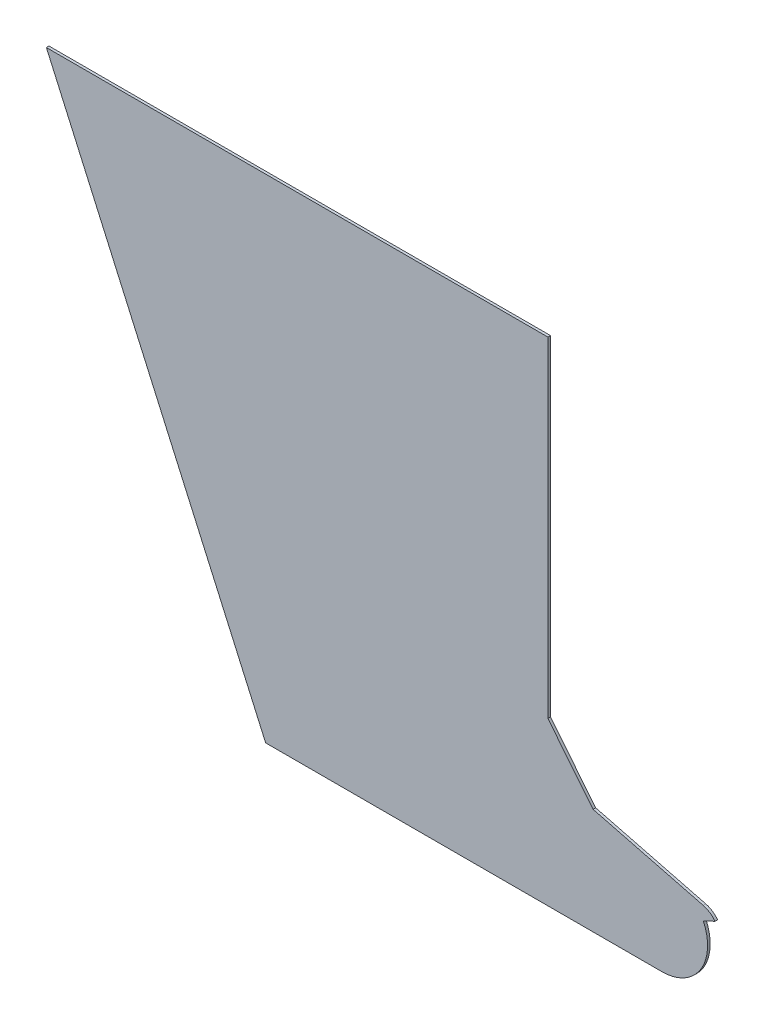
ISO-10303-21;
HEADER;
FILE_DESCRIPTION(('STEP AP214'),'2;1');
FILE_NAME('part.step','',(''),(''),'','','');
FILE_SCHEMA(('AUTOMOTIVE_DESIGN { 1 0 10303 214 1 1 1 1 }'));
ENDSEC;
DATA;
#1=APPLICATION_CONTEXT('core data for automotive mechanical design processes');
#2=APPLICATION_PROTOCOL_DEFINITION('international standard','automotive_design',2000,#1);
#3=PRODUCT_CONTEXT('',#1,'mechanical');
#4=PRODUCT('Part','Part','',(#3));
#5=PRODUCT_RELATED_PRODUCT_CATEGORY('part','',(#4));
#6=PRODUCT_DEFINITION_FORMATION('','',#4);
#7=PRODUCT_DEFINITION_CONTEXT('part definition',#1,'design');
#8=PRODUCT_DEFINITION('design','',#6,#7);
#9=PRODUCT_DEFINITION_SHAPE('','',#8);
#10=(LENGTH_UNIT() NAMED_UNIT(*) SI_UNIT(.MILLI.,.METRE.));
#11=(NAMED_UNIT(*) PLANE_ANGLE_UNIT() SI_UNIT($,.RADIAN.));
#12=(NAMED_UNIT(*) SI_UNIT($,.STERADIAN.) SOLID_ANGLE_UNIT());
#13=UNCERTAINTY_MEASURE_WITH_UNIT(LENGTH_MEASURE(1.E-05),#10,'distance_accuracy_value','');
#14=(GEOMETRIC_REPRESENTATION_CONTEXT(3) GLOBAL_UNCERTAINTY_ASSIGNED_CONTEXT((#13)) GLOBAL_UNIT_ASSIGNED_CONTEXT((#10,
#11,#12)) REPRESENTATION_CONTEXT('',''));
#15=CARTESIAN_POINT('',(0.,0.,0.));
#16=DIRECTION('',(0.,0.,1.));
#17=DIRECTION('',(1.,0.,0.));
#18=AXIS2_PLACEMENT_3D('',#15,#16,#17);
#19=CARTESIAN_POINT('',(-70.7730341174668,-885.405968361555,6.35));
#20=DIRECTION('',(0.,-1.,0.));
#21=DIRECTION('',(0.,0.,-1.));
#22=AXIS2_PLACEMENT_3D('',#19,#20,#21);
#23=PLANE('',#22);
#24=DIRECTION('',(-1.,0.,0.));
#25=VECTOR('',#24,1.);
#26=CARTESIAN_POINT('',(-70.7730341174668,-885.405968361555,0.));
#27=LINE('',#26,#25);
#28=CARTESIAN_POINT('',(1162.91174535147,-885.405968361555,0.));
#29=VERTEX_POINT('',#28);
#30=CARTESIAN_POINT('',(-70.7730341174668,-885.405968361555,0.));
#31=VERTEX_POINT('',#30);
#32=EDGE_CURVE('E134',#29,#31,#27,.T.);
#33=ORIENTED_EDGE('',*,*,#32,.T.);
#34=DIRECTION('',(0.,0.,-1.));
#35=VECTOR('',#34,1.);
#36=CARTESIAN_POINT('',(-70.7730341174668,-885.405968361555,6.35));
#37=LINE('',#36,#35);
#38=CARTESIAN_POINT('',(-70.7730341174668,-885.405968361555,6.35));
#39=VERTEX_POINT('',#38);
#40=EDGE_CURVE('E11',#39,#31,#37,.T.);
#41=ORIENTED_EDGE('',*,*,#40,.F.);
#42=DIRECTION('',(-1.,0.,0.));
#43=VECTOR('',#42,1.);
#44=CARTESIAN_POINT('',(-70.7730341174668,-885.405968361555,6.35));
#45=LINE('',#44,#43);
#46=CARTESIAN_POINT('',(1162.91174535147,-885.405968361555,6.35));
#47=VERTEX_POINT('',#46);
#48=EDGE_CURVE('E150',#47,#39,#45,.T.);
#49=ORIENTED_EDGE('',*,*,#48,.F.);
#50=DIRECTION('',(0.,0.,-1.));
#51=VECTOR('',#50,1.);
#52=CARTESIAN_POINT('',(1162.91174535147,-885.405968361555,6.35));
#53=LINE('',#52,#51);
#54=EDGE_CURVE('E130',#47,#29,#53,.T.);
#55=ORIENTED_EDGE('',*,*,#54,.T.);
#56=EDGE_LOOP('',(#33,#41,#49,#55));
#57=FACE_BOUND('',#56,.T.);
#58=ADVANCED_FACE('F32',(#57),#23,.F.);
#59=CARTESIAN_POINT('',(468.61535827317,-2097.12163758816,6.35));
#60=DIRECTION('',(0.913574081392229,0.406672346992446,0.));
#61=DIRECTION('',(-0.406672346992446,0.913574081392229,0.));
#62=AXIS2_PLACEMENT_3D('',#59,#60,#61);
#63=PLANE('',#62);
#64=DIRECTION('',(0.406672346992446,-0.913574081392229,0.));
#65=VECTOR('',#64,1.);
#66=CARTESIAN_POINT('',(468.61535827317,-2097.12163758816,0.));
#67=LINE('',#66,#65);
#68=CARTESIAN_POINT('',(468.61535827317,-2097.12163758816,0.));
#69=VERTEX_POINT('',#68);
#70=EDGE_CURVE('E137',#31,#69,#67,.T.);
#71=ORIENTED_EDGE('',*,*,#70,.T.);
#72=DIRECTION('',(0.,0.,-1.));
#73=VECTOR('',#72,1.);
#74=CARTESIAN_POINT('',(468.61535827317,-2097.12163758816,6.35));
#75=LINE('',#74,#73);
#76=CARTESIAN_POINT('',(468.61535827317,-2097.12163758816,6.35));
#77=VERTEX_POINT('',#76);
#78=EDGE_CURVE('E40',#77,#69,#75,.T.);
#79=ORIENTED_EDGE('',*,*,#78,.F.);
#80=DIRECTION('',(0.406672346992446,-0.913574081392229,0.));
#81=VECTOR('',#80,1.);
#82=CARTESIAN_POINT('',(468.61535827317,-2097.12163758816,6.35));
#83=LINE('',#82,#81);
#84=EDGE_CURVE('E94',#39,#77,#83,.T.);
#85=ORIENTED_EDGE('',*,*,#84,.F.);
#86=ORIENTED_EDGE('',*,*,#40,.T.);
#87=EDGE_LOOP('',(#71,#79,#85,#86));
#88=FACE_BOUND('',#87,.T.);
#89=ADVANCED_FACE('F193',(#88),#63,.F.);
#90=CARTESIAN_POINT('',(468.61535827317,-2097.12163758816,6.35));
#91=DIRECTION('',(0.,1.,0.));
#92=DIRECTION('',(0.,0.,1.));
#93=AXIS2_PLACEMENT_3D('',#90,#91,#92);
#94=PLANE('',#93);
#95=DIRECTION('',(1.,0.,0.));
#96=VECTOR('',#95,1.);
#97=CARTESIAN_POINT('',(468.61535827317,-2097.12163758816,0.));
#98=LINE('',#97,#96);
#99=CARTESIAN_POINT('',(1443.86174535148,-2097.12163758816,0.));
#100=VERTEX_POINT('',#99);
#101=EDGE_CURVE('E139',#69,#100,#98,.T.);
#102=ORIENTED_EDGE('',*,*,#101,.T.);
#103=DIRECTION('',(0.,0.,-1.));
#104=VECTOR('',#103,1.);
#105=CARTESIAN_POINT('',(1443.86174535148,-2097.12163758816,6.35));
#106=LINE('',#105,#104);
#107=CARTESIAN_POINT('',(1443.86174535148,-2097.12163758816,6.35));
#108=VERTEX_POINT('',#107);
#109=EDGE_CURVE('E160',#108,#100,#106,.T.);
#110=ORIENTED_EDGE('',*,*,#109,.F.);
#111=DIRECTION('',(1.,0.,0.));
#112=VECTOR('',#111,1.);
#113=CARTESIAN_POINT('',(468.61535827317,-2097.12163758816,6.35));
#114=LINE('',#113,#112);
#115=EDGE_CURVE('E168',#77,#108,#114,.T.);
#116=ORIENTED_EDGE('',*,*,#115,.F.);
#117=ORIENTED_EDGE('',*,*,#78,.T.);
#118=EDGE_LOOP('',(#102,#110,#116,#117));
#119=FACE_BOUND('',#118,.T.);
#120=ADVANCED_FACE('F166',(#119),#94,.F.);
#121=CARTESIAN_POINT('',(1443.86174535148,-1985.22163758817,6.35));
#122=DIRECTION('',(0.,0.,-1.));
#123=DIRECTION('',(-1.,0.,0.));
#124=AXIS2_PLACEMENT_3D('',#121,#122,#123);
#125=CYLINDRICAL_SURFACE('',#124,111.899999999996);
#126=CARTESIAN_POINT('',(1443.86174535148,-1985.22163758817,0.));
#127=DIRECTION('',(0.,0.,1.));
#128=DIRECTION('',(-1.,0.,0.));
#129=AXIS2_PLACEMENT_3D('',#126,#127,#128);
#130=CIRCLE('',#129,111.899999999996);
#131=CARTESIAN_POINT('',(1545.27758672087,-1937.93065409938,0.));
#132=VERTEX_POINT('',#131);
#133=EDGE_CURVE('E141',#100,#132,#130,.T.);
#134=ORIENTED_EDGE('',*,*,#133,.T.);
#135=DIRECTION('',(0.,0.,-1.));
#136=VECTOR('',#135,1.);
#137=CARTESIAN_POINT('',(1545.27758672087,-1937.93065409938,6.35));
#138=LINE('',#137,#136);
#139=CARTESIAN_POINT('',(1545.27758672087,-1937.93065409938,6.35));
#140=VERTEX_POINT('',#139);
#141=EDGE_CURVE('E157',#140,#132,#138,.T.);
#142=ORIENTED_EDGE('',*,*,#141,.F.);
#143=CARTESIAN_POINT('',(1443.86174535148,-1985.22163758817,6.35));
#144=DIRECTION('',(0.,0.,1.));
#145=DIRECTION('',(-1.,0.,0.));
#146=AXIS2_PLACEMENT_3D('',#143,#144,#145);
#147=CIRCLE('',#146,111.899999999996);
#148=EDGE_CURVE('E184',#108,#140,#147,.T.);
#149=ORIENTED_EDGE('',*,*,#148,.F.);
#150=ORIENTED_EDGE('',*,*,#109,.T.);
#151=EDGE_LOOP('',(#134,#142,#149,#150));
#152=FACE_BOUND('',#151,.T.);
#153=ADVANCED_FACE('F177',(#152),#125,.T.);
#154=CARTESIAN_POINT('',(1574.05285895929,-1924.51252428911,6.35));
#155=DIRECTION('',(-0.422618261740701,0.906307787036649,0.));
#156=DIRECTION('',(-0.906307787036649,-0.422618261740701,0.));
#157=AXIS2_PLACEMENT_3D('',#154,#155,#156);
#158=PLANE('',#157);
#159=DIRECTION('',(0.906307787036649,0.422618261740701,0.));
#160=VECTOR('',#159,1.);
#161=CARTESIAN_POINT('',(1574.05285895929,-1924.51252428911,0.));
#162=LINE('',#161,#160);
#163=CARTESIAN_POINT('',(1574.05285895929,-1924.51252428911,0.));
#164=VERTEX_POINT('',#163);
#165=EDGE_CURVE('E143',#132,#164,#162,.T.);
#166=ORIENTED_EDGE('',*,*,#165,.T.);
#167=DIRECTION('',(0.,0.,-1.));
#168=VECTOR('',#167,1.);
#169=CARTESIAN_POINT('',(1574.05285895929,-1924.51252428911,6.35));
#170=LINE('',#169,#168);
#171=CARTESIAN_POINT('',(1574.05285895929,-1924.51252428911,6.35));
#172=VERTEX_POINT('',#171);
#173=EDGE_CURVE('E154',#172,#164,#170,.T.);
#174=ORIENTED_EDGE('',*,*,#173,.F.);
#175=DIRECTION('',(0.906307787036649,0.422618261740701,0.));
#176=VECTOR('',#175,1.);
#177=CARTESIAN_POINT('',(1574.05285895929,-1924.51252428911,6.35));
#178=LINE('',#177,#176);
#179=EDGE_CURVE('E183',#140,#172,#178,.T.);
#180=ORIENTED_EDGE('',*,*,#179,.F.);
#181=ORIENTED_EDGE('',*,*,#141,.T.);
#182=EDGE_LOOP('',(#166,#174,#180,#181));
#183=FACE_BOUND('',#182,.T.);
#184=ADVANCED_FACE('F181',(#183),#158,.F.);
#185=CARTESIAN_POINT('',(1531.63285150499,-1956.52730159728,6.35));
#186=DIRECTION('',(0.,0.,-1.));
#187=DIRECTION('',(-1.,0.,0.));
#188=AXIS2_PLACEMENT_3D('',#185,#186,#187);
#189=CYLINDRICAL_SURFACE('',#188,53.1451126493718);
#190=CARTESIAN_POINT('',(1531.63285150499,-1956.52730159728,0.));
#191=DIRECTION('',(0.,0.,1.));
#192=DIRECTION('',(-1.,0.,0.));
#193=AXIS2_PLACEMENT_3D('',#190,#191,#192);
#194=CIRCLE('',#193,53.1451126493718);
#195=CARTESIAN_POINT('',(1544.78611191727,-1905.03560577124,0.));
#196=VERTEX_POINT('',#195);
#197=EDGE_CURVE('E145',#164,#196,#194,.T.);
#198=ORIENTED_EDGE('',*,*,#197,.T.);
#199=DIRECTION('',(0.,0.,-1.));
#200=VECTOR('',#199,1.);
#201=CARTESIAN_POINT('',(1544.78611191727,-1905.03560577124,6.35));
#202=LINE('',#201,#200);
#203=CARTESIAN_POINT('',(1544.78611191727,-1905.03560577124,6.35));
#204=VERTEX_POINT('',#203);
#205=EDGE_CURVE('E125',#204,#196,#202,.T.);
#206=ORIENTED_EDGE('',*,*,#205,.F.);
#207=CARTESIAN_POINT('',(1531.63285150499,-1956.52730159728,6.35));
#208=DIRECTION('',(0.,0.,1.));
#209=DIRECTION('',(-1.,0.,0.));
#210=AXIS2_PLACEMENT_3D('',#207,#208,#209);
#211=CIRCLE('',#210,53.1451126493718);
#212=EDGE_CURVE('E116',#172,#204,#211,.T.);
#213=ORIENTED_EDGE('',*,*,#212,.F.);
#214=ORIENTED_EDGE('',*,*,#173,.T.);
#215=EDGE_LOOP('',(#198,#206,#213,#214));
#216=FACE_BOUND('',#215,.T.);
#217=ADVANCED_FACE('F205',(#216),#189,.T.);
#218=CARTESIAN_POINT('',(1274.11202416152,-1835.89345175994,6.35));
#219=DIRECTION('',(-0.247497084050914,-0.968888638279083,0.));
#220=DIRECTION('',(0.968888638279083,-0.247497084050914,0.));
#221=AXIS2_PLACEMENT_3D('',#218,#219,#220);
#222=PLANE('',#221);
#223=DIRECTION('',(-0.968888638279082,0.247497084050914,0.));
#224=VECTOR('',#223,1.);
#225=CARTESIAN_POINT('',(1274.11202416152,-1835.89345175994,0.));
#226=LINE('',#225,#224);
#227=CARTESIAN_POINT('',(1274.11202416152,-1835.89345175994,0.));
#228=VERTEX_POINT('',#227);
#229=EDGE_CURVE('E124',#196,#228,#226,.T.);
#230=ORIENTED_EDGE('',*,*,#229,.T.);
#231=DIRECTION('',(0.,0.,-1.));
#232=VECTOR('',#231,1.);
#233=CARTESIAN_POINT('',(1274.11202416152,-1835.89345175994,6.35));
#234=LINE('',#233,#232);
#235=CARTESIAN_POINT('',(1274.11202416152,-1835.89345175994,6.35));
#236=VERTEX_POINT('',#235);
#237=EDGE_CURVE('E121',#236,#228,#234,.T.);
#238=ORIENTED_EDGE('',*,*,#237,.F.);
#239=DIRECTION('',(-0.968888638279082,0.247497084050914,0.));
#240=VECTOR('',#239,1.);
#241=CARTESIAN_POINT('',(1274.11202416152,-1835.89345175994,6.35));
#242=LINE('',#241,#240);
#243=EDGE_CURVE('E110',#204,#236,#242,.T.);
#244=ORIENTED_EDGE('',*,*,#243,.F.);
#245=ORIENTED_EDGE('',*,*,#205,.T.);
#246=EDGE_LOOP('',(#230,#238,#244,#245));
#247=FACE_BOUND('',#246,.T.);
#248=ADVANCED_FACE('F122',(#247),#222,.F.);
#249=CARTESIAN_POINT('',(1162.91174535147,-1697.9128888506,6.35));
#250=DIRECTION('',(-0.778618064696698,-0.627498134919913,0.));
#251=DIRECTION('',(0.627498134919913,-0.778618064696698,0.));
#252=AXIS2_PLACEMENT_3D('',#249,#250,#251);
#253=PLANE('',#252);
#254=DIRECTION('',(-0.627498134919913,0.778618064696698,0.));
#255=VECTOR('',#254,1.);
#256=CARTESIAN_POINT('',(1162.91174535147,-1697.9128888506,0.));
#257=LINE('',#256,#255);
#258=CARTESIAN_POINT('',(1162.91174535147,-1697.9128888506,0.));
#259=VERTEX_POINT('',#258);
#260=EDGE_CURVE('E80',#228,#259,#257,.T.);
#261=ORIENTED_EDGE('',*,*,#260,.T.);
#262=DIRECTION('',(0.,0.,-1.));
#263=VECTOR('',#262,1.);
#264=CARTESIAN_POINT('',(1162.91174535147,-1697.9128888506,6.35));
#265=LINE('',#264,#263);
#266=CARTESIAN_POINT('',(1162.91174535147,-1697.9128888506,6.35));
#267=VERTEX_POINT('',#266);
#268=EDGE_CURVE('E126',#267,#259,#265,.T.);
#269=ORIENTED_EDGE('',*,*,#268,.F.);
#270=DIRECTION('',(-0.627498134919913,0.778618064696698,0.));
#271=VECTOR('',#270,1.);
#272=CARTESIAN_POINT('',(1162.91174535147,-1697.9128888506,6.35));
#273=LINE('',#272,#271);
#274=EDGE_CURVE('E114',#236,#267,#273,.T.);
#275=ORIENTED_EDGE('',*,*,#274,.F.);
#276=ORIENTED_EDGE('',*,*,#237,.T.);
#277=EDGE_LOOP('',(#261,#269,#275,#276));
#278=FACE_BOUND('',#277,.T.);
#279=ADVANCED_FACE('F128',(#278),#253,.F.);
#280=CARTESIAN_POINT('',(1162.91174535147,-885.405968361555,6.35));
#281=DIRECTION('',(-1.,0.,0.));
#282=DIRECTION('',(0.,0.,1.));
#283=AXIS2_PLACEMENT_3D('',#280,#281,#282);
#284=PLANE('',#283);
#285=DIRECTION('',(0.,1.,0.));
#286=VECTOR('',#285,1.);
#287=CARTESIAN_POINT('',(1162.91174535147,-885.405968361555,0.));
#288=LINE('',#287,#286);
#289=EDGE_CURVE('E86',#259,#29,#288,.T.);
#290=ORIENTED_EDGE('',*,*,#289,.T.);
#291=ORIENTED_EDGE('',*,*,#54,.F.);
#292=DIRECTION('',(0.,1.,0.));
#293=VECTOR('',#292,1.);
#294=CARTESIAN_POINT('',(1162.91174535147,-885.405968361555,6.35));
#295=LINE('',#294,#293);
#296=EDGE_CURVE('E48',#267,#47,#295,.T.);
#297=ORIENTED_EDGE('',*,*,#296,.F.);
#298=ORIENTED_EDGE('',*,*,#268,.T.);
#299=EDGE_LOOP('',(#290,#291,#297,#298));
#300=FACE_BOUND('',#299,.T.);
#301=ADVANCED_FACE('F213',(#300),#284,.F.);
#302=CARTESIAN_POINT('',(1531.63285150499,-1956.52730159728,6.35));
#303=DIRECTION('',(0.,0.,-1.));
#304=DIRECTION('',(-1.,0.,0.));
#305=AXIS2_PLACEMENT_3D('',#302,#303,#304);
#306=PLANE('',#305);
#307=ORIENTED_EDGE('',*,*,#48,.T.);
#308=ORIENTED_EDGE('',*,*,#84,.T.);
#309=ORIENTED_EDGE('',*,*,#115,.T.);
#310=ORIENTED_EDGE('',*,*,#148,.T.);
#311=ORIENTED_EDGE('',*,*,#179,.T.);
#312=ORIENTED_EDGE('',*,*,#212,.T.);
#313=ORIENTED_EDGE('',*,*,#243,.T.);
#314=ORIENTED_EDGE('',*,*,#274,.T.);
#315=ORIENTED_EDGE('',*,*,#296,.T.);
#316=EDGE_LOOP('',(#307,#308,#309,#310,#311,#312,#313,#314,#315));
#317=FACE_BOUND('',#316,.T.);
#318=ADVANCED_FACE('F112',(#317),#306,.F.);
#319=CARTESIAN_POINT('',(1531.63285150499,-1956.52730159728,0.));
#320=DIRECTION('',(0.,0.,-1.));
#321=DIRECTION('',(-1.,0.,0.));
#322=AXIS2_PLACEMENT_3D('',#319,#320,#321);
#323=PLANE('',#322);
#324=ORIENTED_EDGE('',*,*,#32,.F.);
#325=ORIENTED_EDGE('',*,*,#289,.F.);
#326=ORIENTED_EDGE('',*,*,#260,.F.);
#327=ORIENTED_EDGE('',*,*,#229,.F.);
#328=ORIENTED_EDGE('',*,*,#197,.F.);
#329=ORIENTED_EDGE('',*,*,#165,.F.);
#330=ORIENTED_EDGE('',*,*,#133,.F.);
#331=ORIENTED_EDGE('',*,*,#101,.F.);
#332=ORIENTED_EDGE('',*,*,#70,.F.);
#333=EDGE_LOOP('',(#324,#325,#326,#327,#328,#329,#330,#331,#332));
#334=FACE_BOUND('',#333,.T.);
#335=ADVANCED_FACE('F172',(#334),#323,.T.);
#336=CLOSED_SHELL('',(#58,#89,#120,#153,#184,#217,#248,#279,#301,#318,#335));
#337=MANIFOLD_SOLID_BREP('B2',#336);
#338=ADVANCED_BREP_SHAPE_REPRESENTATION('',(#18,#337),#14);
#339=SHAPE_DEFINITION_REPRESENTATION(#9,#338);
ENDSEC;
END-ISO-10303-21;
